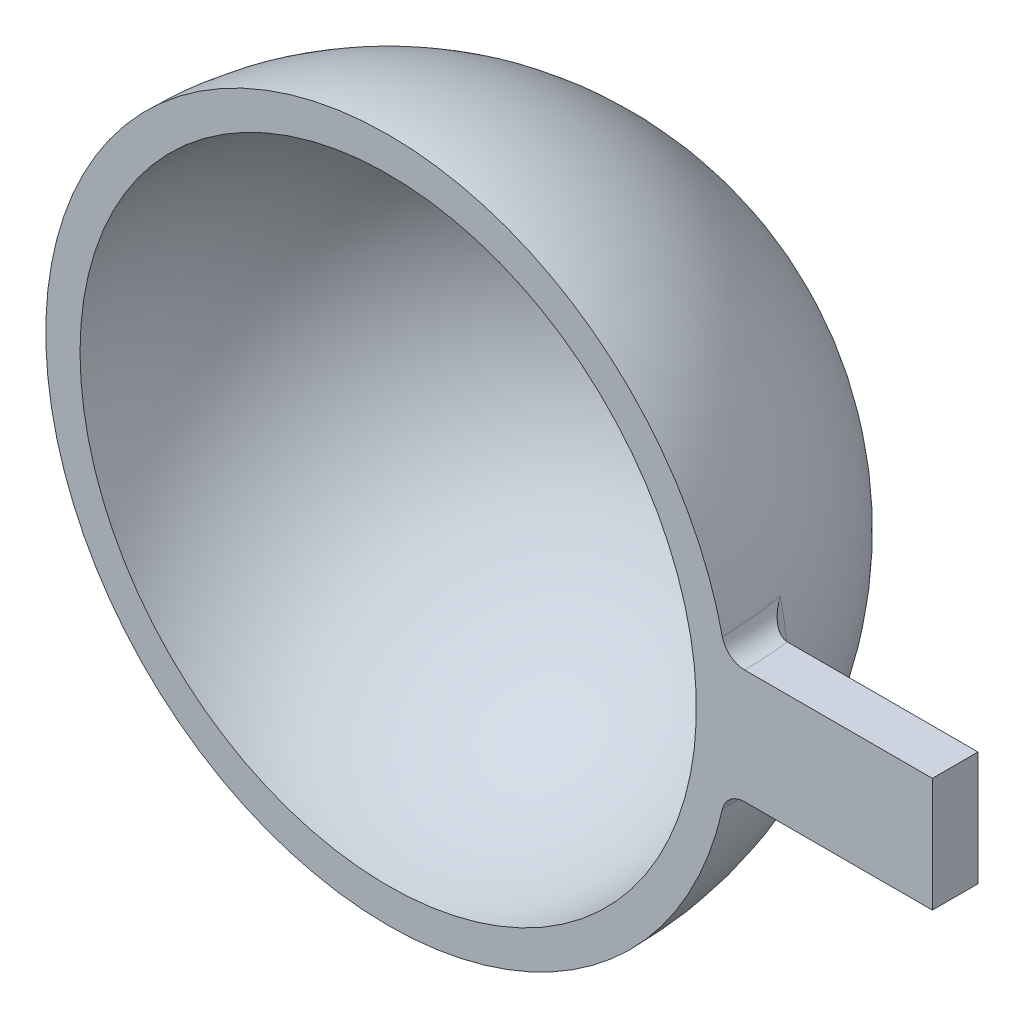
from build123d import *

# Parameters (mm, degrees)
R_VOLUTION1_ANGLE  = 180
ESQUISSE2_W        = 10.316545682
ESQUISSE2_H        = 5
BOSS_EXTRU_1_DEPTH = 2
CONG_1_R           = 1


with BuildPart() as part:
    # Esquisse1 → R_volution1 (revolve)
    with BuildSketch(Plane.XY):
        with BuildLine():
            Line((0, 15), (0, 13.5))
            ThreePointArc((0, 13.5), (-13.5, 0), (0, -13.5))
            Line((0, -13.5), (0, -15))
            ThreePointArc((0, -15), (-15, 0), (0, 15))
        make_face()
    revolve(axis=Axis((0, 18, 0), (0, -1, 0)), revolution_arc=R_VOLUTION1_ANGLE)

    # Esquisse2 → Boss.-Extru.1 (add)
    with BuildSketch(Plane.XY):
        with Locations((18.677184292, 0)):
            Rectangle(ESQUISSE2_W, ESQUISSE2_H)
    extrude(amount=-BOSS_EXTRU_1_DEPTH)

    # Cong_1
    cong_1_edges = [part.edges().sort_by_distance(p)[0] for p in [
        (14.866068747, 0, -2),
        (14.756198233, 2.5, -1.0023042),
        (14.756198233, -2.5, -1.0023042),
    ]]
    fillet(cong_1_edges, radius=CONG_1_R)


solid = part.part
